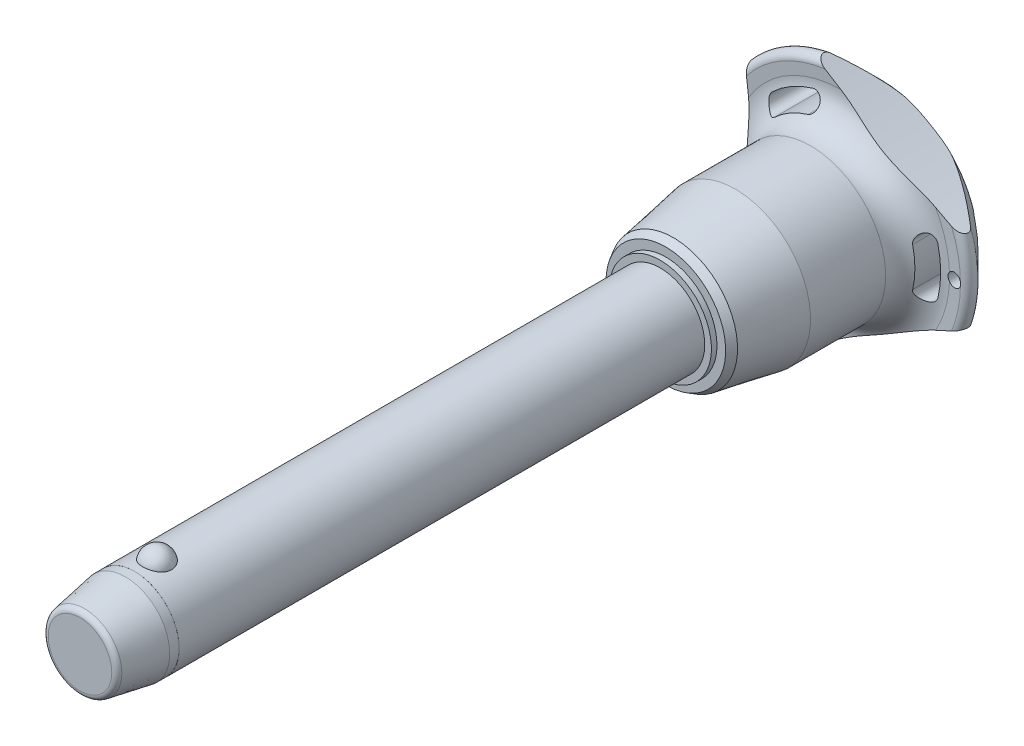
from build123d import *

# Parameters (mm, degrees)
SKETCH1_R           = 10
BOSS_EXTRUDE1_DEPTH = 110
SKETCH2_R           = 8.75
BOSS_EXTRUDE2_DEPTH = 50.7
BOSS_EXTRUDE3_START = 20.5
SKETCH1_2_R         = 10
BOSS_EXTRUDE3_DEPTH = 20.5
CHAMFER1_SIZE       = 10.25
CHAMFER1_SIZE2      = 1.807351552
FILLET1_R           = 1.25
SKETCH6_R           = 176.92625
CUT_EXTRUDE1_DEPTH  = 166.695054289
CIRPATTERN1_COUNT   = 3
SKETCH7_R           = 1.5
CUT_EXTRUDE2_DEPTH  = 166.603156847
SKETCH8_R           = 10
SKETCH8_R_2         = 9.99
CUT_EXTRUDE3_DEPTH  = 12.3


with BuildPart() as part:
    # Sketch1 → Boss-Extrude1 (new body)
    with BuildSketch(Plane.XY):
        Circle(SKETCH1_R)
    extrude(amount=-BOSS_EXTRUDE1_DEPTH)

    # Sketch2 → Boss-Extrude2 (add)
    with BuildSketch(Plane(origin=(0, 0, -110), x_dir=(-1, 0, 0), z_dir=(0, 0, -1))):
        with Locations(Location((0, 0, 0), (0, 0, 180))):
            Circle(SKETCH2_R)
    extrude(amount=BOSS_EXTRUDE2_DEPTH)

    # Sketch3 → Revolve1 (revolve)
    with BuildSketch(Plane(origin=(0, 0, 0), x_dir=(0, 0, -1), z_dir=(1, 0, 0))):
        with BuildLine():
            Line((-3.201562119, 12.5), (-3.201562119, 5.9))
            ThreePointArc((-3.201562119, 5.9), (0.098437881, 9.2), (-3.201562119, 12.5))
        make_face()
        with BuildLine():
            Line((-3.201562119, -5.9), (-3.201562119, -12.5))
            ThreePointArc((-3.201562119, -12.5), (0.098437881, -9.2), (-3.201562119, -5.9))
        make_face()
    revolve(axis=Axis((0, -5.9, 3.201562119), (0, 1, 0)))

    # Sketch1_2 → Boss-Extrude3 (add)
    with BuildSketch(Plane.XY.offset(BOSS_EXTRUDE3_START)):
        Circle(SKETCH1_2_R)
    extrude(amount=-BOSS_EXTRUDE3_DEPTH)

    # Chamfer1
    chamfer1_edges = [part.edges().sort_by_distance(p)[0] for p in [
        (-10, 0, 20.5),
    ]]
    chamfer1_side = [part.faces().sort_by_distance(p)[0] for p in [
        (-10, 0, -44.75),
    ]]
    chamfer(chamfer1_edges, length=CHAMFER1_SIZE, length2=CHAMFER1_SIZE2, reference=chamfer1_side[0])

    # Fillet1
    fillet1_edges = [part.edges().sort_by_distance(p)[0] for p in [
        (-8.192648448, 0, 20.5),
        (-8.75, 0, -160.7),
    ]]
    fillet(fillet1_edges, radius=FILLET1_R)

    # Sketch4 → Revolve2 (revolve)
    with BuildSketch(Plane(origin=(0, 0, 0), x_dir=(0, 0, -1), z_dir=(1, 0, 0)), mode=Mode.PRIVATE) as revolve2_sk:
        Polygon((110, 0), (110, 11.504815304), (111.25, 11.504815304), (111.25, 13.461079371), (112.944174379, 14.439211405), (126.9, 16.9), (143.8, 16.9), (143.8, 0), align=None)
    revolve(revolve2_sk.sketch.rotate(Axis((0, 0, -143.8), (0, 0, 1)), 90), axis=Axis((0, 0, -143.8), (0, 0, 1)))

    # Sketch5 → Revolve3 (revolve)
    with BuildSketch(Plane(origin=(0, 0, 0), x_dir=(0, 0, -1), z_dir=(1, 0, 0)), mode=Mode.PRIVATE) as revolve3_sk:
        with BuildLine():
            Line((150.790129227, 24.271609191), (150.652256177, 26.865060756))
            ThreePointArc((150.652256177, 26.865060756), (151.598671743, 28.411427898), (153.38137085, 28.08137085))
            Line((153.38137085, 28.08137085), (159.763226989, 21.69951471))
            ThreePointArc((159.763226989, 21.69951471), (160.7, 19.381044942), (159.683055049, 17.096604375))
            ThreePointArc((159.683055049, 17.096604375), (154.18864484, 9.321268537), (152.25, 0))
            Line((152.25, 0), (143.8, 0))
            Line((143.8, 0), (143.8, 16.9))
            ThreePointArc((143.8, 16.9), (148.879432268, 19.083427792), (150.790129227, 24.271609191))
        make_face()
    revolve(revolve3_sk.sketch.rotate(Axis((0, 0, -152.25), (0, 0, 1)), 90), axis=Axis((0, 0, -152.25), (0, 0, 1)))

    # Sketch6 → Cut-Extrude1 (cut, through all)
    with BuildSketch(Plane.XY):
        with Locations((-197.42625, 0)):
            Circle(SKETCH6_R)
        with BuildLine():
            ThreePointArc((21.802992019, -5.260839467), (22.428706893, 0), (21.802992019, 5.260839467))
            ThreePointArc((21.802992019, 5.260839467), (19.579234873, 6.620060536), (18.220013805, 4.39630339))
            ThreePointArc((18.220013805, 4.39630339), (18.742902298, 0), (18.220013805, -4.39630339))
            ThreePointArc((18.220013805, -4.39630339), (19.579234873, -6.620060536), (21.802992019, -5.260839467))
        make_face()
    cut_extrude1 = extrude(amount=-CUT_EXTRUDE1_DEPTH, mode=Mode.SUBTRACT)

    # CirPattern1: Cut-Extrude1 ×3 about axis
    cirpattern1_axis = Axis((0, 0, 0), (0, 0, 1))
    for i in range(1, CIRPATTERN1_COUNT):
        add(cut_extrude1.rotate(cirpattern1_axis, i * 360 / CIRPATTERN1_COUNT), mode=Mode.SUBTRACT)

    # Sketch7 → Cut-Extrude2 (cut, through all)
    with BuildSketch(Plane.XY):
        with Locations(Location((25.428706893, 0, 0), (0, 0, 17.230769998))):
            Circle(SKETCH7_R)
    extrude(amount=-CUT_EXTRUDE2_DEPTH, mode=Mode.SUBTRACT)

    # Sketch8 → Cut-Extrude3 (cut)
    with BuildSketch(Plane.XY.offset(20.5)):
        Circle(SKETCH8_R)
        Circle(SKETCH8_R_2, mode=Mode.SUBTRACT)
    extrude(amount=-CUT_EXTRUDE3_DEPTH, mode=Mode.SUBTRACT)


solid = part.part
